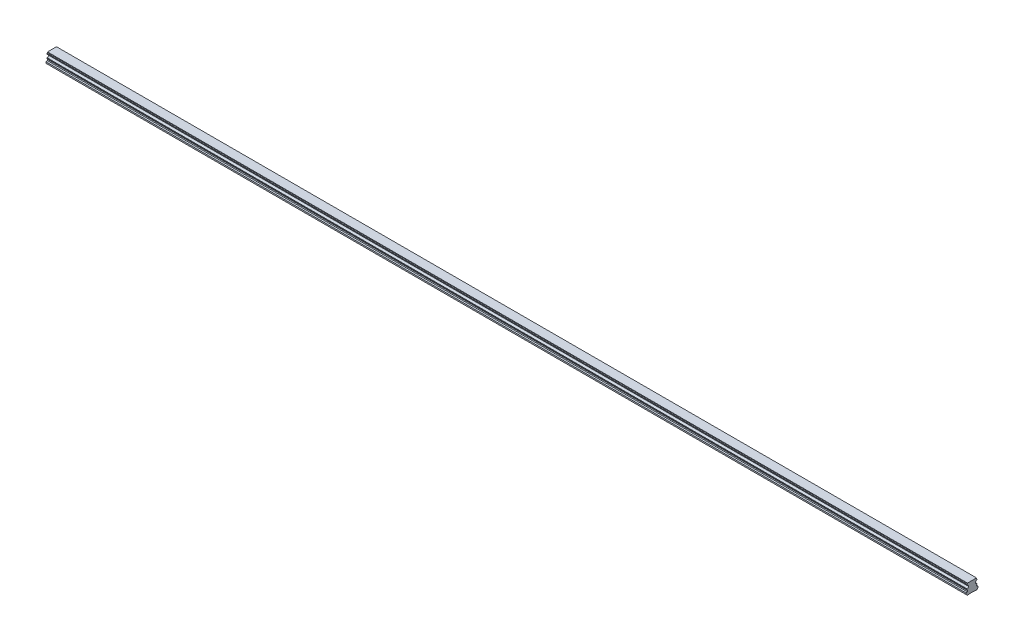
from build123d import *

# Parameters (mm, degrees)
BOSS_EXTRUDE1_DEPTH        = 1920
SKETCH3_R                  = 3
SKETCH3_R_2                = 2.5
CUT_EXTRUDE3_DEPTH         = 12
SKETCH3_2_R                = 2.5
CUT_EXTRUDE4_DEPTH         = 15
CHAMFER1_SIZE              = 0.5
LPATTERN4_COUNT            = 32
LPATTERN4_PITCH            = 60
CHAMFER1_OF_LPATTERN4_SIZE = 0.5


with BuildPart() as part:
    # Sketch1 → Boss-Extrude1 (new body)
    with BuildSketch(Plane(origin=(0, 0, 0), x_dir=(0, 0, -1), z_dir=(1, 0, 0))):
        with BuildLine():
            Line((9.375, 21.8), (-9.375, 21.8))
            Line((-9.375, 21.8), (-9.375, 20.756))
            Line((-9.375, 20.756), (-10, 19.415683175))
            Line((-10, 19.415683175), (-10, 17.685449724))
            ThreePointArc((-10, 17.685449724), (-7.2, 14.6), (-10, 11.514550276))
            Line((-10, 11.514550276), (-10, 9.784316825))
            Line((-10, 9.784316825), (-9.375, 8.444))
            Line((-9.375, 8.444), (-9.922688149, 6.4))
            Line((-9.922688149, 6.4), (-12.5, 5.489338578))
            Line((-12.5, 5.489338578), (-12.5, 2.65))
            Line((-12.5, 2.65), (-9.85, 0))
            Line((-9.85, 0), (-5.5, 0))
            Line((-5.5, 0), (-5, 0.5))
            Line((-5, 0.5), (5, 0.5))
            Line((5, 0.5), (5.5, 0))
            Line((5.5, 0), (9.85, 0))
            Line((9.85, 0), (12.5, 2.65))
            Line((12.5, 2.65), (12.5, 5.489338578))
            Line((12.5, 5.489338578), (9.922688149, 6.4))
            Line((9.922688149, 6.4), (9.375, 8.444))
            Line((9.375, 8.444), (10, 9.784316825))
            Line((10, 9.784316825), (10, 11.514550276))
            ThreePointArc((10, 11.514550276), (7.2, 14.6), (10, 17.685449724))
            Line((10, 17.685449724), (10, 19.415683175))
            Line((10, 19.415683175), (9.375, 20.756))
            Line((9.375, 20.756), (9.375, 21.8))
        make_face()
    extrude(amount=BOSS_EXTRUDE1_DEPTH)

    # Sketch3 → Cut-Extrude3 (cut)
    with BuildSketch(Plane.XZ):
        with Locations(Location((30, 0, 0), (0, 0, 270))):
            Circle(SKETCH3_R)
        with Locations(Location((30, 0, 0), (0, 0, 270))):
            Circle(SKETCH3_R_2, mode=Mode.SUBTRACT)
    cut_extrude3 = extrude(amount=-CUT_EXTRUDE3_DEPTH, mode=Mode.SUBTRACT)

    # Sketch3_2 → Cut-Extrude4 (cut)
    with BuildSketch(Plane.XZ):
        with Locations(Location((30, 0, 0), (0, 0, 270))):
            Circle(SKETCH3_2_R)
    cut_extrude4 = extrude(amount=-CUT_EXTRUDE4_DEPTH, mode=Mode.SUBTRACT)

    # Cut-Extrude5 cone 1 section (on through the dimple's axis) → Cut-Extrude5 (revolve, cut)
    with BuildSketch(Plane(origin=(30, 15, 0), x_dir=(0, 0, -1), z_dir=(1, 0, 0))):
        Polygon((0, 0), (2.5, 0), (0, 1.443375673), align=None)
    cut_extrude5 = revolve(axis=Axis((30, 15, 0), (0, 1, 0)), mode=Mode.SUBTRACT)

    # Chamfer1
    chamfer1_edges = [part.edges().sort_by_distance(p)[0] for p in [
        (30, 0.5, 3),
    ]]
    chamfer(chamfer1_edges, length=CHAMFER1_SIZE)

    # LPattern4: Cut-Extrude3, Cut-Extrude4, Cut-Extrude5 ×32
    with Locations(*[(i * LPATTERN4_PITCH, 0, 0) for i in range(1, LPATTERN4_COUNT)]):
        add(cut_extrude3, mode=Mode.SUBTRACT)
        add(cut_extrude4, mode=Mode.SUBTRACT)
        add(cut_extrude5, mode=Mode.SUBTRACT)

    # Chamfer1 of LPattern4
    chamfer1_of_lpattern4_edges = [part.edges().sort_by_distance(p)[0] for p in [
        (90, 0.5, 3),
        (150, 0.5, 3),
        (210, 0.5, 3),
        (270, 0.5, 3),
        (330, 0.5, 3),
        (390, 0.5, 3),
        (450, 0.5, 3),
        (510, 0.5, 3),
        (570, 0.5, 3),
        (630, 0.5, 3),
        (690, 0.5, 3),
        (750, 0.5, 3),
        (810, 0.5, 3),
        (870, 0.5, 3),
        (930, 0.5, 3),
        (990, 0.5, 3),
        (1050, 0.5, 3),
        (1110, 0.5, 3),
        (1170, 0.5, 3),
        (1230, 0.5, 3),
        (1290, 0.5, 3),
        (1350, 0.5, 3),
        (1410, 0.5, 3),
        (1470, 0.5, 3),
        (1530, 0.5, 3),
        (1590, 0.5, 3),
        (1650, 0.5, 3),
        (1710, 0.5, 3),
        (1770, 0.5, 3),
        (1830, 0.5, 3),
        (1890, 0.5, 3),
    ]]
    chamfer(chamfer1_of_lpattern4_edges, length=CHAMFER1_OF_LPATTERN4_SIZE)


solid = part.part
